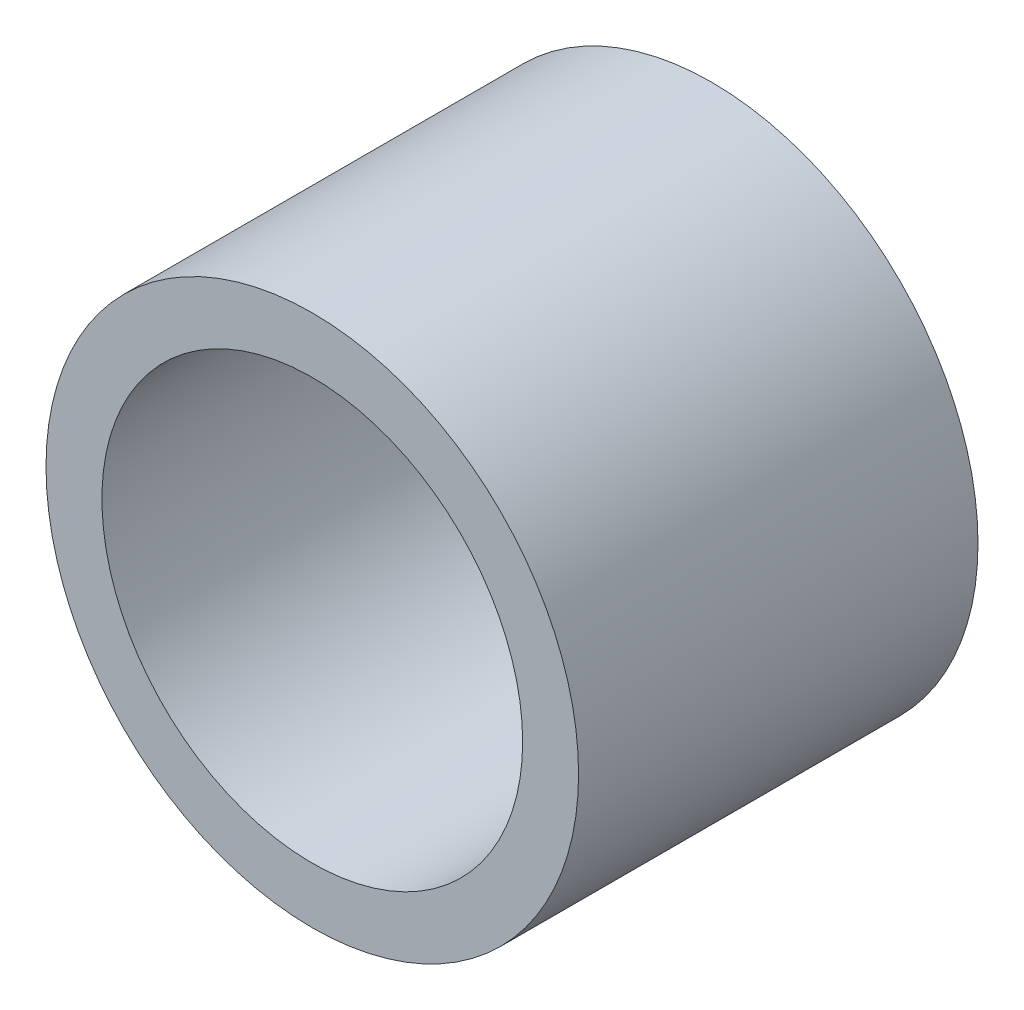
from build123d import *

# Parameters (mm, degrees)
SKETCH1_R         = 25.4
CAP_DEPTH         = 38.1
SKETCH2_R         = 20.066
CBORE_DEPTH       = 30.988
SKETCH3_R         = 2.413
MOUNT_HOLES_DEPTH = 30.988
SKETCH4_R         = 4.064
MOUNT_CBORE_DEPTH = 1.524


with BuildPart() as part:
    # Sketch1 → cap (new body)
    with BuildSketch(Plane.XY):
        with Locations(Location((0, 0, 0), (0, 0, 180))):
            Circle(SKETCH1_R)
    extrude(amount=CAP_DEPTH)

    # Sketch2 → cbore (cut)
    with BuildSketch(Plane.XY.offset(38.1)):
        Circle(SKETCH2_R)
    extrude(amount=-CBORE_DEPTH, mode=Mode.SUBTRACT)

    # Sketch3 → mount_holes (cut)
    with BuildSketch(Plane(origin=(0, 0, 0), x_dir=(-1, 0, 0), z_dir=(0, 0, -1))):
        with Locations((7.62, 12.7)):
            Circle(SKETCH3_R)
        with Locations(Location((7.62, -12.7, 0), (0, 0, 180))):
            Circle(SKETCH3_R)
    extrude(amount=-MOUNT_HOLES_DEPTH, mode=Mode.SUBTRACT)

    # Sketch4 → mount_cbore (cut)
    with BuildSketch(Plane(origin=(0, 0, 0), x_dir=(-1, 0, 0), z_dir=(0, 0, -1))):
        with Locations((7.62, 12.7)):
            Circle(SKETCH4_R)
        with Locations((7.62, -12.7)):
            Circle(SKETCH4_R)
    extrude(amount=-MOUNT_CBORE_DEPTH, mode=Mode.SUBTRACT)


solid = part.part
